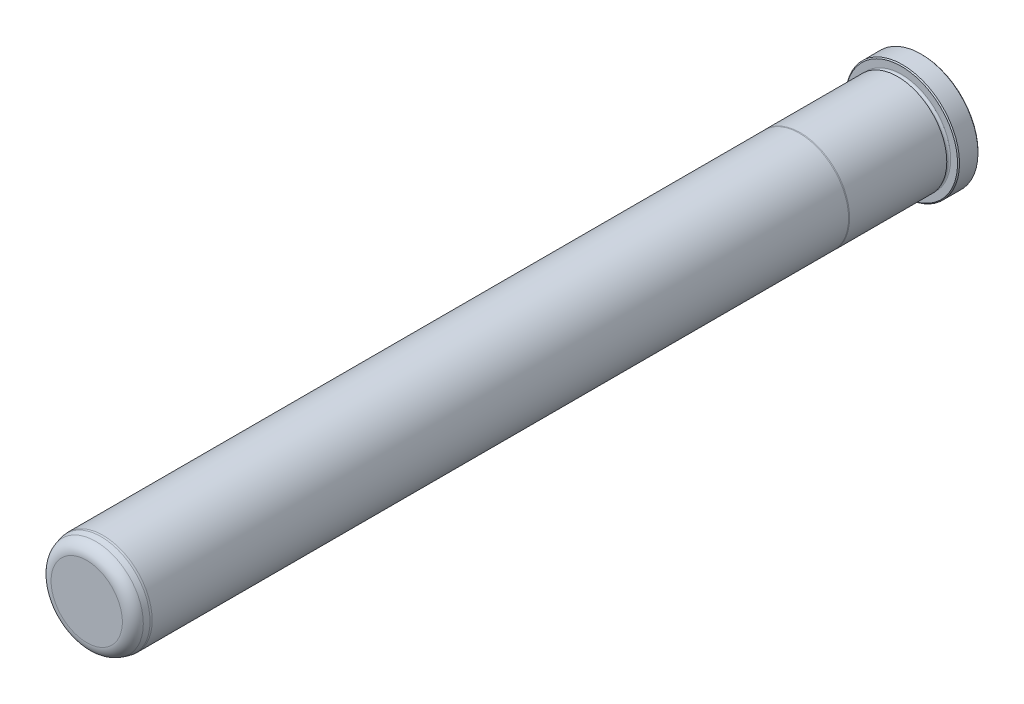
ISO-10303-21;
HEADER;
FILE_DESCRIPTION(('STEP AP214'),'2;1');
FILE_NAME('part.step','',(''),(''),'','','');
FILE_SCHEMA(('AUTOMOTIVE_DESIGN { 1 0 10303 214 1 1 1 1 }'));
ENDSEC;
DATA;
#1=APPLICATION_CONTEXT('core data for automotive mechanical design processes');
#2=APPLICATION_PROTOCOL_DEFINITION('international standard','automotive_design',2000,#1);
#3=PRODUCT_CONTEXT('',#1,'mechanical');
#4=PRODUCT('Part','Part','',(#3));
#5=PRODUCT_RELATED_PRODUCT_CATEGORY('part','',(#4));
#6=PRODUCT_DEFINITION_FORMATION('','',#4);
#7=PRODUCT_DEFINITION_CONTEXT('part definition',#1,'design');
#8=PRODUCT_DEFINITION('design','',#6,#7);
#9=PRODUCT_DEFINITION_SHAPE('','',#8);
#10=(LENGTH_UNIT() NAMED_UNIT(*) SI_UNIT(.MILLI.,.METRE.));
#11=(NAMED_UNIT(*) PLANE_ANGLE_UNIT() SI_UNIT($,.RADIAN.));
#12=(NAMED_UNIT(*) SI_UNIT($,.STERADIAN.) SOLID_ANGLE_UNIT());
#13=UNCERTAINTY_MEASURE_WITH_UNIT(LENGTH_MEASURE(1.E-05),#10,'distance_accuracy_value','');
#14=(GEOMETRIC_REPRESENTATION_CONTEXT(3) GLOBAL_UNCERTAINTY_ASSIGNED_CONTEXT((#13)) GLOBAL_UNIT_ASSIGNED_CONTEXT((#10,
#11,#12)) REPRESENTATION_CONTEXT('',''));
#15=CARTESIAN_POINT('',(0.,0.,0.));
#16=DIRECTION('',(0.,0.,1.));
#17=DIRECTION('',(1.,0.,0.));
#18=AXIS2_PLACEMENT_3D('',#15,#16,#17);
#19=CARTESIAN_POINT('',(0.,0.,0.));
#20=DIRECTION('',(0.,0.,1.));
#21=DIRECTION('',(1.,0.,0.));
#22=AXIS2_PLACEMENT_3D('',#19,#20,#21);
#23=PLANE('',#22);
#24=CARTESIAN_POINT('',(0.,0.,0.));
#25=DIRECTION('',(0.,0.,1.));
#26=DIRECTION('',(1.,0.,0.));
#27=AXIS2_PLACEMENT_3D('',#24,#25,#26);
#28=CIRCLE('',#27,21.717);
#29=CARTESIAN_POINT('',(21.717,0.,0.));
#30=VERTEX_POINT('',#29);
#31=EDGE_CURVE('E37',#30,#30,#28,.F.);
#32=ORIENTED_EDGE('',*,*,#31,.T.);
#33=EDGE_LOOP('',(#32));
#34=FACE_BOUND('',#33,.T.);
#35=ADVANCED_FACE('F30',(#34),#23,.F.);
#36=CARTESIAN_POINT('',(0.,0.,0.));
#37=DIRECTION('',(0.,0.,1.));
#38=DIRECTION('',(1.,0.,0.));
#39=AXIS2_PLACEMENT_3D('',#36,#37,#38);
#40=CYLINDRICAL_SURFACE('',#39,22.098);
#41=CARTESIAN_POINT('',(0.,0.,0.380999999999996));
#42=DIRECTION('',(0.,0.,1.));
#43=DIRECTION('',(1.,0.,0.));
#44=AXIS2_PLACEMENT_3D('',#41,#42,#43);
#45=CIRCLE('',#44,22.098);
#46=CARTESIAN_POINT('',(22.098,0.,0.380999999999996));
#47=VERTEX_POINT('',#46);
#48=EDGE_CURVE('E41',#47,#47,#45,.T.);
#49=ORIENTED_EDGE('',*,*,#48,.T.);
#50=EDGE_LOOP('',(#49));
#51=FACE_BOUND('',#50,.T.);
#52=CARTESIAN_POINT('',(0.,0.,7.54379999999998));
#53=DIRECTION('',(0.,0.,-1.));
#54=DIRECTION('',(-1.,0.,0.));
#55=AXIS2_PLACEMENT_3D('',#52,#53,#54);
#56=CIRCLE('',#55,22.098);
#57=CARTESIAN_POINT('',(-22.098,0.,7.54379999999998));
#58=VERTEX_POINT('',#57);
#59=EDGE_CURVE('E45',#58,#58,#56,.T.);
#60=ORIENTED_EDGE('',*,*,#59,.T.);
#61=EDGE_LOOP('',(#60));
#62=FACE_BOUND('',#61,.T.);
#63=ADVANCED_FACE('F118',(#51,#62),#40,.T.);
#64=CARTESIAN_POINT('',(0.,22.098,7.9248));
#65=DIRECTION('',(0.,0.,-1.));
#66=DIRECTION('',(-1.,0.,0.));
#67=AXIS2_PLACEMENT_3D('',#64,#65,#66);
#68=PLANE('',#67);
#69=CARTESIAN_POINT('',(0.,0.,7.9248));
#70=DIRECTION('',(0.,0.,-1.));
#71=DIRECTION('',(-1.,0.,0.));
#72=AXIS2_PLACEMENT_3D('',#69,#70,#71);
#73=CIRCLE('',#72,21.717);
#74=CARTESIAN_POINT('',(-21.717,0.,7.9248));
#75=VERTEX_POINT('',#74);
#76=EDGE_CURVE('E10',#75,#75,#73,.F.);
#77=ORIENTED_EDGE('',*,*,#76,.T.);
#78=EDGE_LOOP('',(#77));
#79=FACE_BOUND('',#78,.T.);
#80=CARTESIAN_POINT('',(0.,0.,7.9248));
#81=DIRECTION('',(0.,0.,1.));
#82=DIRECTION('',(1.,0.,0.));
#83=AXIS2_PLACEMENT_3D('',#80,#81,#82);
#84=CIRCLE('',#83,19.0373);
#85=CARTESIAN_POINT('',(19.0373,0.,7.9248));
#86=VERTEX_POINT('',#85);
#87=EDGE_CURVE('E56',#86,#86,#84,.T.);
#88=ORIENTED_EDGE('',*,*,#87,.F.);
#89=EDGE_LOOP('',(#88));
#90=FACE_BOUND('',#89,.T.);
#91=ADVANCED_FACE('F113',(#79,#90),#68,.F.);
#92=CARTESIAN_POINT('',(0.,0.,8.6868));
#93=DIRECTION('',(0.,0.,1.));
#94=DIRECTION('',(1.,0.,0.));
#95=AXIS2_PLACEMENT_3D('',#92,#93,#94);
#96=TOROIDAL_SURFACE('',#95,19.0373,0.762);
#97=CARTESIAN_POINT('',(0.,0.,9.4488));
#98=DIRECTION('',(0.,0.,1.));
#99=DIRECTION('',(1.,0.,0.));
#100=AXIS2_PLACEMENT_3D('',#97,#98,#99);
#101=CIRCLE('',#100,19.0373);
#102=CARTESIAN_POINT('',(19.0373,0.,9.4488));
#103=VERTEX_POINT('',#102);
#104=EDGE_CURVE('E59',#103,#103,#101,.T.);
#105=ORIENTED_EDGE('',*,*,#104,.F.);
#106=EDGE_LOOP('',(#105));
#107=FACE_BOUND('',#106,.T.);
#108=ORIENTED_EDGE('',*,*,#87,.T.);
#109=EDGE_LOOP('',(#108));
#110=FACE_BOUND('',#109,.T.);
#111=ADVANCED_FACE('F107',(#107,#110),#96,.F.);
#112=CARTESIAN_POINT('',(0.,19.0373,9.4488));
#113=DIRECTION('',(0.,0.,1.));
#114=DIRECTION('',(1.,0.,0.));
#115=AXIS2_PLACEMENT_3D('',#112,#113,#114);
#116=PLANE('',#115);
#117=CARTESIAN_POINT('',(0.,0.,9.4488));
#118=DIRECTION('',(0.,0.,1.));
#119=DIRECTION('',(1.,0.,0.));
#120=AXIS2_PLACEMENT_3D('',#117,#118,#119);
#121=CIRCLE('',#120,19.0627);
#122=CARTESIAN_POINT('',(19.0627,0.,9.4488));
#123=VERTEX_POINT('',#122);
#124=EDGE_CURVE('E62',#123,#123,#121,.T.);
#125=ORIENTED_EDGE('',*,*,#124,.F.);
#126=EDGE_LOOP('',(#125));
#127=FACE_BOUND('',#126,.T.);
#128=ORIENTED_EDGE('',*,*,#104,.T.);
#129=EDGE_LOOP('',(#128));
#130=FACE_BOUND('',#129,.T.);
#131=ADVANCED_FACE('F101',(#127,#130),#116,.F.);
#132=CARTESIAN_POINT('',(0.,0.,0.));
#133=DIRECTION('',(0.,0.,1.));
#134=DIRECTION('',(1.,0.,0.));
#135=AXIS2_PLACEMENT_3D('',#132,#133,#134);
#136=CYLINDRICAL_SURFACE('',#135,19.0627);
#137=CARTESIAN_POINT('',(0.,0.,47.1347630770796));
#138=DIRECTION('',(0.,0.,1.));
#139=DIRECTION('',(1.,0.,0.));
#140=AXIS2_PLACEMENT_3D('',#137,#138,#139);
#141=CIRCLE('',#140,19.0627);
#142=CARTESIAN_POINT('',(19.0627,0.,47.1347630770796));
#143=VERTEX_POINT('',#142);
#144=EDGE_CURVE('E65',#143,#143,#141,.T.);
#145=ORIENTED_EDGE('',*,*,#144,.F.);
#146=EDGE_LOOP('',(#145));
#147=FACE_BOUND('',#146,.T.);
#148=ORIENTED_EDGE('',*,*,#124,.T.);
#149=EDGE_LOOP('',(#148));
#150=FACE_BOUND('',#149,.T.);
#151=ADVANCED_FACE('F95',(#147,#150),#136,.T.);
#152=CARTESIAN_POINT('',(0.,0.,47.1347630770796));
#153=DIRECTION('',(0.,0.,-1.));
#154=DIRECTION('',(-1.,0.,0.));
#155=AXIS2_PLACEMENT_3D('',#152,#153,#154);
#156=CONICAL_SURFACE('',#155,19.0627,0.0698131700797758);
#157=CARTESIAN_POINT('',(0.,0.,47.498));
#158=DIRECTION('',(0.,0.,1.));
#159=DIRECTION('',(1.,0.,0.));
#160=AXIS2_PLACEMENT_3D('',#157,#158,#159);
#161=CIRCLE('',#160,19.0373);
#162=CARTESIAN_POINT('',(19.0373,0.,47.498));
#163=VERTEX_POINT('',#162);
#164=EDGE_CURVE('E68',#163,#163,#161,.T.);
#165=ORIENTED_EDGE('',*,*,#164,.F.);
#166=EDGE_LOOP('',(#165));
#167=FACE_BOUND('',#166,.T.);
#168=ORIENTED_EDGE('',*,*,#144,.T.);
#169=EDGE_LOOP('',(#168));
#170=FACE_BOUND('',#169,.T.);
#171=ADVANCED_FACE('F89',(#167,#170),#156,.T.);
#172=CARTESIAN_POINT('',(0.,0.,0.));
#173=DIRECTION('',(0.,0.,1.));
#174=DIRECTION('',(1.,0.,0.));
#175=AXIS2_PLACEMENT_3D('',#172,#173,#174);
#176=CYLINDRICAL_SURFACE('',#175,19.0373);
#177=CARTESIAN_POINT('',(0.,0.,317.5));
#178=DIRECTION('',(0.,0.,1.));
#179=DIRECTION('',(1.,0.,0.));
#180=AXIS2_PLACEMENT_3D('',#177,#178,#179);
#181=CIRCLE('',#180,19.0373);
#182=CARTESIAN_POINT('',(19.0373,0.,317.5));
#183=VERTEX_POINT('',#182);
#184=EDGE_CURVE('E71',#183,#183,#181,.T.);
#185=ORIENTED_EDGE('',*,*,#184,.F.);
#186=EDGE_LOOP('',(#185));
#187=FACE_BOUND('',#186,.T.);
#188=ORIENTED_EDGE('',*,*,#164,.T.);
#189=EDGE_LOOP('',(#188));
#190=FACE_BOUND('',#189,.T.);
#191=ADVANCED_FACE('F83',(#187,#190),#176,.T.);
#192=CARTESIAN_POINT('',(0.,0.,317.5));
#193=DIRECTION('',(0.,0.,-1.));
#194=DIRECTION('',(-1.,0.,0.));
#195=AXIS2_PLACEMENT_3D('',#192,#193,#194);
#196=CONICAL_SURFACE('',#195,19.0373,0.0872664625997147);
#197=CARTESIAN_POINT('',(0.,0.,318.262));
#198=DIRECTION('',(0.,0.,1.));
#199=DIRECTION('',(1.,0.,0.));
#200=AXIS2_PLACEMENT_3D('',#197,#198,#199);
#201=CIRCLE('',#200,18.9706336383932);
#202=CARTESIAN_POINT('',(18.9706336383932,0.,318.262));
#203=VERTEX_POINT('',#202);
#204=EDGE_CURVE('E74',#203,#203,#201,.T.);
#205=ORIENTED_EDGE('',*,*,#204,.F.);
#206=EDGE_LOOP('',(#205));
#207=FACE_BOUND('',#206,.T.);
#208=ORIENTED_EDGE('',*,*,#184,.T.);
#209=EDGE_LOOP('',(#208));
#210=FACE_BOUND('',#209,.T.);
#211=ADVANCED_FACE('F80',(#207,#210),#196,.T.);
#212=CARTESIAN_POINT('',(0.,0.,318.262));
#213=DIRECTION('',(0.,0.,-1.));
#214=DIRECTION('',(-1.,0.,0.));
#215=AXIS2_PLACEMENT_3D('',#212,#213,#214);
#216=CONICAL_SURFACE('',#215,18.9706336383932,0.261799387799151);
#217=CARTESIAN_POINT('',(0.,0.,320.320125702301));
#218=DIRECTION('',(0.,0.,1.));
#219=DIRECTION('',(1.,0.,0.));
#220=AXIS2_PLACEMENT_3D('',#217,#218,#219);
#221=CIRCLE('',#220,18.41916051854);
#222=CARTESIAN_POINT('',(18.41916051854,0.,320.320125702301));
#223=VERTEX_POINT('',#222);
#224=EDGE_CURVE('E50',#223,#223,#221,.F.);
#225=ORIENTED_EDGE('',*,*,#224,.T.);
#226=EDGE_LOOP('',(#225));
#227=FACE_BOUND('',#226,.T.);
#228=ORIENTED_EDGE('',*,*,#204,.T.);
#229=EDGE_LOOP('',(#228));
#230=FACE_BOUND('',#229,.T.);
#231=ADVANCED_FACE('F78',(#227,#230),#216,.T.);
#232=CARTESIAN_POINT('',(0.,17.4733335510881,323.85));
#233=DIRECTION('',(0.,0.,-1.));
#234=DIRECTION('',(-1.,0.,0.));
#235=AXIS2_PLACEMENT_3D('',#232,#233,#234);
#236=PLANE('',#235);
#237=CARTESIAN_POINT('',(0.,0.,323.85));
#238=DIRECTION('',(0.,0.,-1.));
#239=DIRECTION('',(-1.,0.,0.));
#240=AXIS2_PLACEMENT_3D('',#237,#238,#239);
#241=CIRCLE('',#240,13.8189387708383);
#242=CARTESIAN_POINT('',(-13.8189387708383,0.,323.85));
#243=VERTEX_POINT('',#242);
#244=EDGE_CURVE('E53',#243,#243,#241,.F.);
#245=ORIENTED_EDGE('',*,*,#244,.T.);
#246=EDGE_LOOP('',(#245));
#247=FACE_BOUND('',#246,.T.);
#248=ADVANCED_FACE('F133',(#247),#236,.F.);
#249=CARTESIAN_POINT('',(0.,0.,319.0875));
#250=DIRECTION('',(0.,0.,-1.));
#251=DIRECTION('',(-1.,0.,0.));
#252=AXIS2_PLACEMENT_3D('',#249,#250,#251);
#253=TOROIDAL_SURFACE('',#252,13.8189387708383,4.7625);
#254=ORIENTED_EDGE('',*,*,#224,.F.);
#255=EDGE_LOOP('',(#254));
#256=FACE_BOUND('',#255,.T.);
#257=ORIENTED_EDGE('',*,*,#244,.F.);
#258=EDGE_LOOP('',(#257));
#259=FACE_BOUND('',#258,.T.);
#260=ADVANCED_FACE('F130',(#256,#259),#253,.T.);
#261=CARTESIAN_POINT('',(0.,0.,0.380999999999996));
#262=DIRECTION('',(0.,0.,1.));
#263=DIRECTION('',(1.,0.,0.));
#264=AXIS2_PLACEMENT_3D('',#261,#262,#263);
#265=CONICAL_SURFACE('',#264,22.098,0.785398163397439);
#266=ORIENTED_EDGE('',*,*,#31,.F.);
#267=EDGE_LOOP('',(#266));
#268=FACE_BOUND('',#267,.T.);
#269=ORIENTED_EDGE('',*,*,#48,.F.);
#270=EDGE_LOOP('',(#269));
#271=FACE_BOUND('',#270,.T.);
#272=ADVANCED_FACE('F132',(#268,#271),#265,.T.);
#273=CARTESIAN_POINT('',(0.,0.,7.9248));
#274=DIRECTION('',(0.,0.,-1.));
#275=DIRECTION('',(-1.,0.,0.));
#276=AXIS2_PLACEMENT_3D('',#273,#274,#275);
#277=CONICAL_SURFACE('',#276,21.717,0.785398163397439);
#278=ORIENTED_EDGE('',*,*,#59,.F.);
#279=EDGE_LOOP('',(#278));
#280=FACE_BOUND('',#279,.T.);
#281=ORIENTED_EDGE('',*,*,#76,.F.);
#282=EDGE_LOOP('',(#281));
#283=FACE_BOUND('',#282,.T.);
#284=ADVANCED_FACE('F32',(#280,#283),#277,.T.);
#285=CLOSED_SHELL('',(#35,#63,#91,#111,#131,#151,#171,#191,#211,#231,#248,#260,#272,#284));
#286=MANIFOLD_SOLID_BREP('B2',#285);
#287=ADVANCED_BREP_SHAPE_REPRESENTATION('',(#18,#286),#14);
#288=SHAPE_DEFINITION_REPRESENTATION(#9,#287);
ENDSEC;
END-ISO-10303-21;
